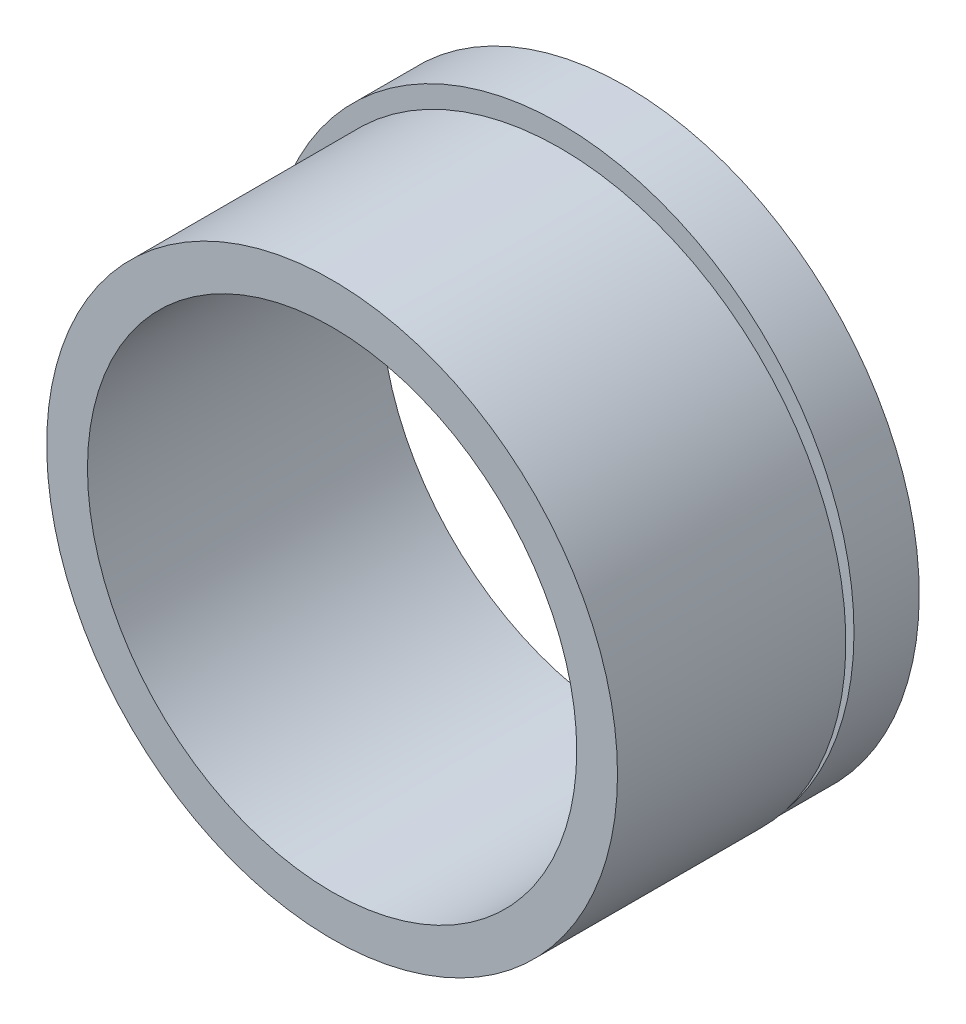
from build123d import *

# Parameters (mm, degrees)
ESQUISSE1_R          = 17.5
ESQUISSE1_R_2        = 15
BASE_EXTRUSION_DEPTH = 14
BOSS_EXTRU_1_START   = 4
ESQUISSE2_R          = 18
ESQUISSE2_R_2        = 15
BOSS_EXTRU_1_DEPTH   = 4


with BuildPart() as part:
    # Esquisse1 → Base-Extrusion (new body)
    with BuildSketch(Plane.XY):
        with Locations(Location((0, 0, 0), (0, 0, 217.667014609))):
            Circle(ESQUISSE1_R)
        with Locations(Location((0, 0, 0), (0, 0, 180))):
            Circle(ESQUISSE1_R_2, mode=Mode.SUBTRACT)
    extrude(amount=BASE_EXTRUSION_DEPTH)

    # Esquisse2 → Boss.-Extru.1 (add)
    with BuildSketch(Plane(origin=(0, 0, 0), x_dir=(-1, 0, 0), z_dir=(0, 0, -1)).offset(BOSS_EXTRU_1_START)):
        with Locations(Location((0, 0.8, 0), (0, 0, 219.683161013))):
            Circle(ESQUISSE2_R)
        Circle(ESQUISSE2_R_2, mode=Mode.SUBTRACT)
    extrude(amount=-BOSS_EXTRU_1_DEPTH)


solid = part.part
